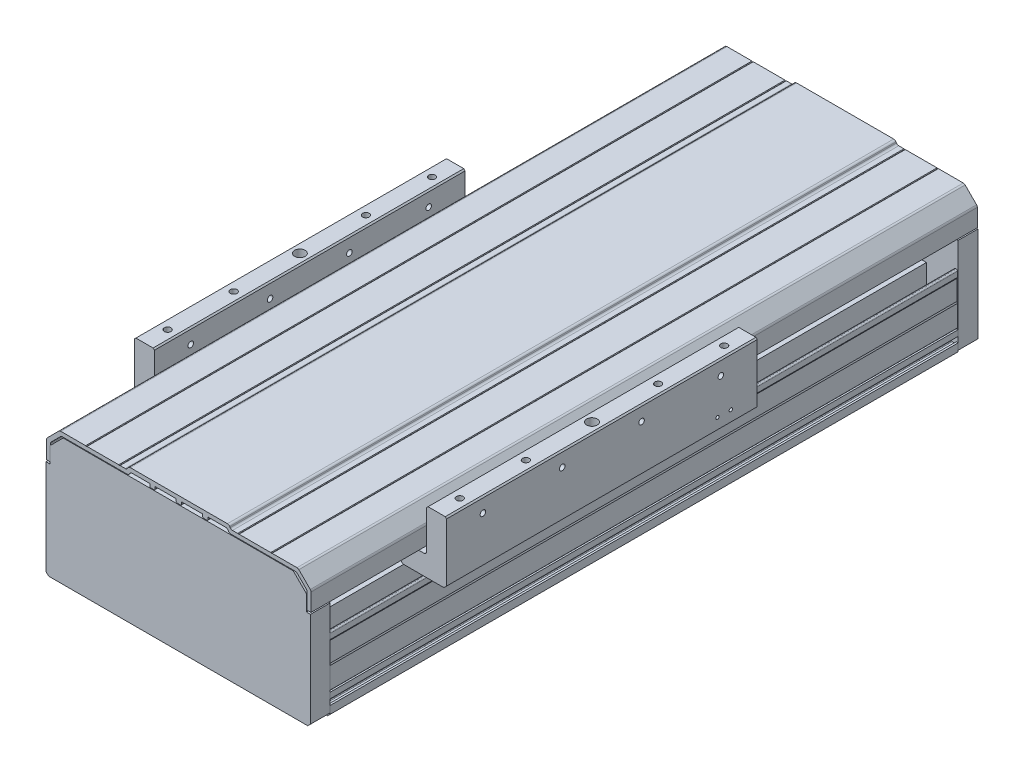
from build123d import *

# Parameters (mm, degrees)
EXTRUDE_1_DEPTH             = 237.5
EXTRUDE_2_DEPTH             = 15
EXTRUDE_3_DEPTH             = 15
EXTRUDE_4_DEPTH             = 235
EXTRUDE_5_DEPTH             = 252
HOLE_WIZARD_M8_1_AT_2_COUNT = 2
HOLE_WIZARD_M8_1_AT_2_PITCH = 173
PATTERN_LINEAR_1_COUNT      = 2
PATTERN_LINEAR_1_PITCH      = 240
HOLE_WIZARD_M6_1_AT_2_COUNT = 2
HOLE_WIZARD_M6_1_AT_2_PITCH = 50
HOLE_WIZARD_M6_1_AT_3_COUNT = 2
HOLE_WIZARD_M6_1_AT_3_PITCH = 150
HOLE_WIZARD_M6_1_AT_4_COUNT = 2
HOLE_WIZARD_M6_1_AT_4_PITCH = 200
HOLE_WIZARD_M5_1_AT_2_COUNT = 2
HOLE_WIZARD_M5_1_AT_2_PITCH = 60
HOLE_WIZARD_M5_1_AT_3_COUNT = 2
HOLE_WIZARD_M5_1_AT_3_PITCH = 120
HOLE_WIZARD_M5_1_AT_4_COUNT = 2
HOLE_WIZARD_M5_1_AT_4_PITCH = 180
SKETCH_13_R                 = 2.5
CUT_EXTRUDE_1_DEPTH         = 47
SKETCH_14_R                 = 4
CUT_EXTRUDE_2_DEPTH         = 18
HOLE_WIZARD_M3_1_AT_2_COUNT = 2
HOLE_WIZARD_M3_1_AT_2_PITCH = 10


with BuildPart() as part:
    # Sketch 1 → Extrude 1 (new, symmetric)
    # profile 1 of 3: a face of its own
    with BuildSketch(Plane.XY):
        with BuildLine():
            Line((-99, 33.5), (-99, 48.5))
            Line((-99, 48.5), (-99.5, 49.5))
            Line((-99.5, 49.5), (-99.5, 53.5))
            ThreePointArc((-99.5, 53.5), (-99.207106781, 54.207106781), (-98.5, 54.5))
            Line((-98.5, 54.5), (-98, 54.5))
            ThreePointArc((-98, 54.5), (-97.292893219, 54.207106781), (-97, 53.5))
            Line((-97, 53.5), (-97, 16.5))
            ThreePointArc((-97, 16.5), (-97.146446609, 16.146446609), (-97.5, 16))
            Line((-97.5, 16), (-99, 16))
            ThreePointArc((-99, 16), (-99.353553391, 16.146446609), (-99.5, 16.5))
            Line((-99.5, 16.5), (-99.5, 32.5))
            Line((-99.5, 32.5), (-99, 33.5))
        make_face()
    # profile 2 of 3: a face of its own
    with BuildSketch(Plane.XY):
        with BuildLine():
            Line((99, 33.5), (99, 48.5))
            Line((99, 48.5), (99.5, 49.5))
            Line((99.5, 49.5), (99.5, 53.5))
            ThreePointArc((99.5, 53.5), (99.207106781, 54.207106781), (98.5, 54.5))
            Line((98.5, 54.5), (98, 54.5))
            ThreePointArc((98, 54.5), (97.292893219, 54.207106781), (97, 53.5))
            Line((97, 53.5), (97, 16.5))
            ThreePointArc((97, 16.5), (97.146446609, 16.146446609), (97.5, 16))
            Line((97.5, 16), (99, 16))
            ThreePointArc((99, 16), (99.353553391, 16.146446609), (99.5, 16.5))
            Line((99.5, 16.5), (99.5, 32.5))
            Line((99.5, 32.5), (99, 33.5))
        make_face()
    # profile 3 of 3: a face of its own
    with BuildSketch(Plane.XY):
        with BuildLine():
            Line((-78, 44.5), (-43.5, 44.5))
            Line((-43.5, 44.5), (-43.5, 22.499959))
            ThreePointArc((-43.5, 22.499959), (-42.035533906, 18.964425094), (-38.5, 17.499959))
            Line((-38.5, 17.499959), (-38.5, 16.499959))
            Line((-38.5, 16.499959), (-22.9999959, 16.499959))
            Line((-22.9999959, 16.499959), (-22.5, 15.999959))
            Line((-22.5, 15.999959), (22.5, 15.999959))
            Line((22.5, 15.999959), (22.9999959, 16.499959))
            Line((22.9999959, 16.499959), (38.5, 16.499959))
            Line((38.5, 16.499959), (38.5, 17.499959))
            ThreePointArc((38.5, 17.499959), (42.035533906, 18.964425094), (43.5, 22.499959))
            Line((43.5, 22.499959), (43.5, 44.5))
            Line((43.5, 44.5), (71, 44.5))
            Line((71, 44.5), (71, 47.5))
            Line((71, 47.5), (76, 47.5))
            Line((76, 47.5), (76, 31.4999))
            Line((76, 31.4999), (76.3, 31.4999))
            Line((76.3, 31.4999), (76.3, 24.58099761))
            ThreePointArc((76.3, 24.58099761), (76.246719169, 24.583200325), (76.193631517, 24.588240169))
            ThreePointArc((76.193631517, 24.588240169), (74.617365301, 22.19481599), (77.476923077, 22.384615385))
            ThreePointArc((77.476923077, 22.384615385), (77.845299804, 22.832050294), (78.4, 23))
            Line((78.4, 23), (80.8, 23))
            Line((80.8, 23), (81, 22.8))
            Line((81, 22.8), (81, 21.2))
            Line((81, 21.2), (80.8, 21))
            Line((80.8, 21), (79.5, 21))
            Line((79.5, 21), (79.5, 18))
            Line((79.5, 18), (93.5, 18))
            Line((93.5, 18), (93.5, 21))
            Line((93.5, 21), (92.2, 21))
            Line((92.2, 21), (92, 21.2))
            Line((92, 21.2), (92, 22.8))
            Line((92, 22.8), (92.2, 23))
            Line((92.2, 23), (94, 23))
            ThreePointArc((94, 23), (94.707106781, 23.292893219), (95, 24))
            Line((95, 24), (95, 25.5))
            Line((95, 25.5), (97, 25.5))
            Line((97, 25.5), (97, 22.000000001))
            Line((97, 22.000000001), (96.7, 21.5))
            Line((96.7, 21.5), (97, 21))
            Line((97, 21), (97, 15.5))
            Line((97, 15.5), (100, 15.5))
            Line((100, 15.5), (99.999985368, 11.15))
            Line((99.999985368, 11.15), (98.499985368, 11.15))
            Line((98.499985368, 11.15), (98.499985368, 12.65))
            Line((98.499985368, 12.65), (95.499985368, 12.65))
            ThreePointArc((95.499985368, 12.65), (95.146431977, 12.503553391), (94.999985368, 12.15))
            Line((94.999985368, 12.15), (94.999985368, 5.85))
            ThreePointArc((94.999985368, 5.85), (95.146431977, 5.496446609), (95.499985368, 5.35))
            Line((95.499985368, 5.35), (98.499985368, 5.35))
            Line((98.499985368, 5.35), (98.499985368, 6.85))
            Line((98.499985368, 6.85), (99.999985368, 6.85))
            Line((99.999985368, 6.85), (100, 1))
            Line((100, 1), (98, -1))
            Line((98, -1), (36, -1))
            Line((36, -1), (35, 0))
            Line((35, 0), (-35, 0))
            Line((-35, 0), (-36, -1))
            Line((-36, -1), (-98, -1))
            Line((-98, -1), (-100, 1))
            Line((-100, 1), (-99.999985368, 6.85))
            Line((-99.999985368, 6.85), (-98.499985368, 6.85))
            Line((-98.499985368, 6.85), (-98.499985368, 5.35))
            Line((-98.499985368, 5.35), (-95.499985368, 5.35))
            ThreePointArc((-95.499985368, 5.35), (-95.146431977, 5.496446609), (-94.999985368, 5.85))
            Line((-94.999985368, 5.85), (-94.999985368, 12.15))
            ThreePointArc((-94.999985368, 12.15), (-95.146431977, 12.503553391), (-95.499985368, 12.65))
            Line((-95.499985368, 12.65), (-98.499985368, 12.65))
            Line((-98.499985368, 12.65), (-98.499985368, 11.15))
            Line((-98.499985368, 11.15), (-99.999985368, 11.15))
            Line((-99.999985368, 11.15), (-100, 15.5))
            Line((-100, 15.5), (-97, 15.5))
            Line((-97, 15.5), (-97, 21))
            Line((-97, 21), (-96.7, 21.5))
            Line((-96.7, 21.5), (-97, 22))
            Line((-97, 22), (-97, 25.5))
            Line((-97, 25.5), (-95, 25.5))
            Line((-95, 25.5), (-95, 24))
            ThreePointArc((-95, 24), (-94.707106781, 23.292893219), (-94, 23))
            Line((-94, 23), (-92.2, 23))
            Line((-92.2, 23), (-92, 22.8))
            Line((-92, 22.8), (-92, 21.2))
            Line((-92, 21.2), (-92.2, 21))
            Line((-92.2, 21), (-93.5, 21))
            Line((-93.5, 21), (-93.5, 18))
            Line((-93.5, 18), (-79.5, 18))
            Line((-79.5, 18), (-79.5, 21))
            Line((-79.5, 21), (-80.8, 21))
            Line((-80.8, 21), (-81, 21.2))
            Line((-81, 21.2), (-81, 22.8))
            Line((-81, 22.8), (-80.8, 23))
            Line((-80.8, 23), (-78.4, 23))
            ThreePointArc((-78.4, 23), (-77.845299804, 22.832050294), (-77.476923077, 22.384615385))
            ThreePointArc((-77.476923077, 22.384615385), (-74.617365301, 22.19481599), (-76.193631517, 24.588240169))
            ThreePointArc((-76.193631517, 24.588240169), (-76.76123201, 24.686146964), (-77.180676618, 25.080890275))
            Line((-77.180676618, 25.080890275), (-78, 26.5))
            Line((-78, 26.5), (-78, 36.5))
            Line((-78, 36.5), (-77.7, 37))
            Line((-77.7, 37), (-78, 37.5))
            Line((-78, 37.5), (-78, 44.5))
        make_face()
        with BuildLine():
            Line((-66.55, 32.5), (-54.5, 32.5))
            ThreePointArc((-54.5, 32.5), (-53.085786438, 31.914213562), (-52.5, 30.5))
            Line((-52.5, 30.5), (-52.5, 16.25))
            ThreePointArc((-52.5, 16.25), (-52.353553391, 15.896446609), (-52, 15.75))
            Line((-52, 15.75), (-51.407878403, 15.75))
            ThreePointArc((-51.407878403, 15.75), (-51.235654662, 15.780597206), (-51.084509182, 15.868644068))
            ThreePointArc((-51.084509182, 15.868644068), (-47.054594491, 13.850026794), (-51.300978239, 12.338983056))
            ThreePointArc((-51.300978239, 12.338983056), (-51.467890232, 12.457980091), (-51.668524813, 12.5))
            Line((-51.668524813, 12.5), (-67.5, 12.5))
            ThreePointArc((-67.5, 12.5), (-68.914213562, 13.085786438), (-69.5, 14.5))
            Line((-69.5, 14.5), (-69.5, 30.092681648))
            ThreePointArc((-69.5, 30.092681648), (-69.617656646, 30.414882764), (-69.915254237, 30.58544747))
            ThreePointArc((-69.915254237, 30.58544747), (-71.07878547, 34.873482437), (-67.05, 33))
            ThreePointArc((-67.05, 33), (-66.903553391, 32.646446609), (-66.55, 32.5))
        make_face(mode=Mode.SUBTRACT)
        with BuildLine():
            Line((-16.901923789, 9.5), (-14.303847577, 11))
            Line((-14.303847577, 11), (-7.333333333, 11))
            Line((-7.333333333, 11), (-4, 9))
            Line((-4, 9), (4, 9))
            Line((4, 9), (7.333333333, 11))
            Line((7.333333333, 11), (14.303847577, 11))
            Line((14.303847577, 11), (16.901923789, 9.5))
            Line((16.901923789, 9.5), (18.062862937, 9.5))
            ThreePointArc((18.062862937, 9.5), (22.45, 8), (18.062862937, 6.5))
            Line((18.062862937, 6.5), (16.901923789, 6.5))
            Line((16.901923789, 6.5), (14.303847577, 5))
            Line((14.303847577, 5), (-14.303847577, 5))
            Line((-14.303847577, 5), (-16.901923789, 6.5))
            Line((-16.901923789, 6.5), (-18.062862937, 6.5))
            ThreePointArc((-18.062862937, 6.5), (-22.45, 8), (-18.062862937, 9.5))
            Line((-18.062862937, 9.5), (-16.901923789, 9.5))
        make_face(mode=Mode.SUBTRACT)
        with BuildLine():
            Line((66.549999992, 32.500000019), (54.499999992, 32.500000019))
            ThreePointArc((54.499999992, 32.500000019), (53.085786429, 31.914213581), (52.499999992, 30.500000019))
            Line((52.499999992, 30.500000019), (52.499999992, 16.250000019))
            ThreePointArc((52.499999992, 16.250000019), (52.353553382, 15.896446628), (51.999999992, 15.750000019))
            Line((51.999999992, 15.750000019), (51.407878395, 15.750000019))
            ThreePointArc((51.407878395, 15.750000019), (51.235654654, 15.780597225), (51.084509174, 15.868644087))
            ThreePointArc((51.084509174, 15.868644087), (47.054594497, 13.850026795), (51.30097824, 12.338983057))
            ThreePointArc((51.30097824, 12.338983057), (51.467890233, 12.457980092), (51.668524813, 12.5))
            Line((51.668524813, 12.5), (67.5, 12.5))
            ThreePointArc((67.5, 12.5), (68.914213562, 13.085786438), (69.5, 14.5))
            Line((69.5, 14.5), (69.5, 30.092681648))
            ThreePointArc((69.5, 30.092681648), (69.617656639, 30.414882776), (69.915254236, 30.585447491))
            ThreePointArc((69.915254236, 30.585447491), (71.078785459, 34.873482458), (67.049999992, 33.000000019))
            ThreePointArc((67.049999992, 33.000000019), (66.903553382, 32.646446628), (66.549999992, 32.500000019))
        make_face(mode=Mode.SUBTRACT)
    extrude(amount=EXTRUDE_1_DEPTH, both=True)

    # Sketch 7 → Hole Wizard M8 _ _ _ _1 (revolve, cut)
    with BuildSketch(Plane(origin=(-86.5, 18, 120), x_dir=(0, 0, 1), z_dir=(1, 0, 0))):
        Polygon((0, 0), (0, 19), (4.5, 19), (4.5, 9), (7, 9), (7, 0), align=None)
    hole_wizard_m8_1 = revolve(axis=Axis((-86.5, 24.35, 120), (0, -1, 0)), mode=Mode.SUBTRACT)

    # Hole Wizard M8 _ _ _ _1 at 2: Hole Wizard M8 _ _ _ _1 ×2
    with Locations(*[(i * HOLE_WIZARD_M8_1_AT_2_PITCH, 0, 0) for i in range(1, HOLE_WIZARD_M8_1_AT_2_COUNT)]):
        add(hole_wizard_m8_1, mode=Mode.SUBTRACT)

    # Pattern Linear 1: Hole Wizard M8 _ _ _ _1 ×2
    with Locations(*[(0, 0, -i * PATTERN_LINEAR_1_PITCH) for i in range(1, PATTERN_LINEAR_1_COUNT)]):
        add(hole_wizard_m8_1, mode=Mode.SUBTRACT)

    # Pattern Linear 1 copy 1 sketch → Pattern Linear 1 copy 1 (revolve, cut)
    with BuildSketch(Plane(origin=(86.5, 18, -120), x_dir=(0, 0, 1), z_dir=(1, 0, 0))):
        Polygon((0, 0), (0, 19), (4.5, 19), (4.5, 9), (7, 9), (7, 0), align=None)
    revolve(axis=Axis((86.5, 24.35, -120), (0, -1, 0)), mode=Mode.SUBTRACT)


with BuildPart() as body_2:
    # Sketch 2 → Extrude 2 (new body)
    with BuildSketch(Plane.XY.offset(237.5)):
        Polygon((97.000014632, 86.000015), (87.000014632, 96.000015), (-86.999985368, 96.000015), (-96.999985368, 86.000015), (-96.999985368, 74), (-99.999985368, 74), (-99.999985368, 2), (-97.999985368, 0), (97.999985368, 0), (100.000014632, 2.000029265), (100.000014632, 74), (97.000014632, 74), align=None)
    extrude(amount=EXTRUDE_2_DEPTH)


with BuildPart() as body_3:
    # Sketch 3 → Extrude 3 (new body)
    with BuildSketch(Plane(origin=(0, 0, -237.5), x_dir=(-1, 0, 0), z_dir=(0, 0, -1))):
        Polygon((97.000014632, 86.000015), (87.000014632, 96.000015), (-86.999985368, 96.000015), (-96.999985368, 86.000015), (-96.999985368, 74), (-99.999985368, 74), (-99.999985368, 2), (-97.999985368, 0), (97.999985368, 0), (100.000014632, 2.000029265), (100.000014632, 74), (97.000014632, 74), align=None)
    extrude(amount=EXTRUDE_3_DEPTH)


with BuildPart() as body_4:
    # Sketch 4 → Extrude 4 (new body)
    with BuildSketch(Plane.XY.offset(167.5)):
        with BuildLine():
            ThreePointArc((-103, 74), (-102.414213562, 72.585786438), (-101, 72))
            Line((-101, 72), (-96, 72))
            ThreePointArc((-96, 72), (-94.585786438, 72.585786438), (-94, 74))
            Line((-94, 74), (-94, 77.5))
            ThreePointArc((-94, 77.5), (-91.071067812, 84.571067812), (-84, 87.5))
            Line((-84, 87.5), (-58.5, 87.5))
            Line((-58.5, 87.5), (-56.5, 89.5))
            Line((-56.5, 89.5), (56.5, 89.5))
            Line((56.5, 89.5), (58.5, 87.5))
            Line((58.5, 87.5), (84, 87.5))
            ThreePointArc((84, 87.5), (91.071067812, 84.571067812), (94, 77.5))
            Line((94, 77.5), (94, 74))
            ThreePointArc((94, 74), (94.585786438, 72.585786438), (96, 72))
            Line((96, 72), (101, 72))
            ThreePointArc((101, 72), (102.414213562, 72.585786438), (103, 74))
            Line((103, 74), (103, 103))
            Line((103, 103), (104, 104))
            Line((104, 104), (117, 104))
            Line((117, 104), (118, 103))
            Line((118, 103), (118, 59))
            Line((118, 59), (116, 57))
            Line((116, 57), (85, 57))
            Line((85, 57), (83, 59))
            Line((83, 59), (83, 72.5))
            Line((83, 72.5), (-83, 72.5))
            Line((-83, 72.5), (-83, 59))
            Line((-83, 59), (-85, 57))
            Line((-85, 57), (-116, 57))
            Line((-116, 57), (-118, 59))
            Line((-118, 59), (-118, 103))
            Line((-118, 103), (-117, 104))
            Line((-117, 104), (-104, 104))
            Line((-104, 104), (-103, 103))
            Line((-103, 103), (-103, 74))
        make_face()
    extrude(amount=-EXTRUDE_4_DEPTH)

    # Sketch 9 → Hole Wizard M6 _ _1 (revolve, cut)
    with BuildSketch(Plane(origin=(110.5, 104, 150), x_dir=(0, 0, 1), z_dir=(1, 0, 0))):
        Polygon((0, 0), (0, 24.502151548), (2.5, 23), (2.5, 0), align=None)
    hole_wizard_m6_1 = revolve(axis=Axis((110.5, 110.35, 150), (0, -1, 0)), mode=Mode.SUBTRACT)

    # Hole Wizard M6 _ _1 at 2: Hole Wizard M6 _ _1 ×2
    with Locations(*[(0, 0, -i * HOLE_WIZARD_M6_1_AT_2_PITCH) for i in range(1, HOLE_WIZARD_M6_1_AT_2_COUNT)]):
        add(hole_wizard_m6_1, mode=Mode.SUBTRACT)

    # Hole Wizard M6 _ _1 at 3: Hole Wizard M6 _ _1 ×2
    with Locations(*[(0, 0, -i * HOLE_WIZARD_M6_1_AT_3_PITCH) for i in range(1, HOLE_WIZARD_M6_1_AT_3_COUNT)]):
        add(hole_wizard_m6_1, mode=Mode.SUBTRACT)

    # Hole Wizard M6 _ _1 at 4: Hole Wizard M6 _ _1 ×2
    with Locations(*[(0, 0, -i * HOLE_WIZARD_M6_1_AT_4_PITCH) for i in range(1, HOLE_WIZARD_M6_1_AT_4_COUNT)]):
        add(hole_wizard_m6_1, mode=Mode.SUBTRACT)

    # Sketch 11 → Hole Wizard M5 _ _1 (revolve, cut)
    with BuildSketch(Plane(origin=(118, 93, 140), x_dir=(0, 0, -1), z_dir=(0, 1, 0))):
        Polygon((0, 0), (0, 17.2618073), (2.1, 16), (2.1, 0), align=None)
    hole_wizard_m5_1 = revolve(axis=Axis((124.35, 93, 140), (-1, 0, 0)), mode=Mode.SUBTRACT)

    # Hole Wizard M5 _ _1 at 2: Hole Wizard M5 _ _1 ×2
    with Locations(*[(0, 0, -i * HOLE_WIZARD_M5_1_AT_2_PITCH) for i in range(1, HOLE_WIZARD_M5_1_AT_2_COUNT)]):
        add(hole_wizard_m5_1, mode=Mode.SUBTRACT)

    # Hole Wizard M5 _ _1 at 3: Hole Wizard M5 _ _1 ×2
    with Locations(*[(0, 0, -i * HOLE_WIZARD_M5_1_AT_3_PITCH) for i in range(1, HOLE_WIZARD_M5_1_AT_3_COUNT)]):
        add(hole_wizard_m5_1, mode=Mode.SUBTRACT)

    # Hole Wizard M5 _ _1 at 4: Hole Wizard M5 _ _1 ×2
    with Locations(*[(0, 0, -i * HOLE_WIZARD_M5_1_AT_4_PITCH) for i in range(1, HOLE_WIZARD_M5_1_AT_4_COUNT)]):
        add(hole_wizard_m5_1, mode=Mode.SUBTRACT)

    # Sketch 13 → Cut-Extrude 1 (cut)
    with BuildSketch(Plane(origin=(0, 104, 0), x_dir=(1, 0, 0), z_dir=(0, 1, 0))):
        with Locations(Location((110.5, -50, 0), (0, 0, 270))):
            Circle(SKETCH_13_R)
    cut_extrude_1 = extrude(amount=-CUT_EXTRUDE_1_DEPTH, mode=Mode.SUBTRACT)

    # Sketch 14 → Cut-Extrude 2 (cut)
    with BuildSketch(Plane(origin=(0, 104, 0), x_dir=(1, 0, 0), z_dir=(0, 1, 0))):
        with Locations(Location((110.5, -50, 0), (0, 0, 270))):
            Circle(SKETCH_14_R)
    cut_extrude_2 = extrude(amount=-CUT_EXTRUDE_2_DEPTH, mode=Mode.SUBTRACT)

    # Mirror 1: Hole Wizard M6 _ _1, Hole Wizard M5 _ _1, Cut-Extrude 1, Cut-Extrude 2 across plane
    add(hole_wizard_m6_1.mirror(Plane(origin=(0, 0, 0), x_dir=(0, 0, 1), z_dir=(1, 0, 0))), mode=Mode.SUBTRACT)
    add(hole_wizard_m5_1.mirror(Plane(origin=(0, 0, 0), x_dir=(0, 0, 1), z_dir=(1, 0, 0))), mode=Mode.SUBTRACT)
    add(cut_extrude_1.mirror(Plane(origin=(0, 0, 0), x_dir=(0, 0, 1), z_dir=(1, 0, 0))), mode=Mode.SUBTRACT)
    add(cut_extrude_2.mirror(Plane(origin=(0, 0, 0), x_dir=(0, 0, 1), z_dir=(1, 0, 0))), mode=Mode.SUBTRACT)

    # Mirror 1 copy 1 sketch → Mirror 1 copy 1 (revolve, cut)
    with BuildSketch(Plane(origin=(-110.5, 104, 100), x_dir=(0, 0, 1), z_dir=(-1, 0, 0))):
        Polygon((0, 0), (0, -24.502151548), (2.5, -23), (2.5, 0), align=None)
    revolve(axis=Axis((-110.5, 110.35, 100), (0, 1, 0)), mode=Mode.SUBTRACT)

    # Mirror 1 copy 2 sketch → Mirror 1 copy 2 (revolve, cut)
    with BuildSketch(Plane(origin=(-110.5, 104, 0), x_dir=(0, 0, 1), z_dir=(-1, 0, 0))):
        Polygon((0, 0), (0, -24.502151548), (2.5, -23), (2.5, 0), align=None)
    revolve(axis=Axis((-110.5, 110.35, 0), (0, 1, 0)), mode=Mode.SUBTRACT)

    # Mirror 1 copy 3 sketch → Mirror 1 copy 3 (revolve, cut)
    with BuildSketch(Plane(origin=(-110.5, 104, -50), x_dir=(0, 0, 1), z_dir=(-1, 0, 0))):
        Polygon((0, 0), (0, -24.502151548), (2.5, -23), (2.5, 0), align=None)
    revolve(axis=Axis((-110.5, 110.35, -50), (0, 1, 0)), mode=Mode.SUBTRACT)

    # Mirror 1 copy 4 sketch → Mirror 1 copy 4 (revolve, cut)
    with BuildSketch(Plane(origin=(-118, 93, 80), x_dir=(0, 0, -1), z_dir=(0, 1, 0))):
        Polygon((0, 0), (0, -17.2618073), (2.1, -16), (2.1, 0), align=None)
    revolve(axis=Axis((-124.35, 93, 80), (-1, 0, 0)), mode=Mode.SUBTRACT)

    # Mirror 1 copy 5 sketch → Mirror 1 copy 5 (revolve, cut)
    with BuildSketch(Plane(origin=(-118, 93, 20), x_dir=(0, 0, -1), z_dir=(0, 1, 0))):
        Polygon((0, 0), (0, -17.2618073), (2.1, -16), (2.1, 0), align=None)
    revolve(axis=Axis((-124.35, 93, 20), (-1, 0, 0)), mode=Mode.SUBTRACT)

    # Mirror 1 copy 6 sketch → Mirror 1 copy 6 (revolve, cut)
    with BuildSketch(Plane(origin=(-118, 93, -40), x_dir=(0, 0, -1), z_dir=(0, 1, 0))):
        Polygon((0, 0), (0, -17.2618073), (2.1, -16), (2.1, 0), align=None)
    revolve(axis=Axis((-124.35, 93, -40), (-1, 0, 0)), mode=Mode.SUBTRACT)

    # Sketch 15 → Hole Wizard M3 _ _1 (revolve, cut)
    with BuildSketch(Plane(origin=(118, 67, -47.5), x_dir=(0, 0, -1), z_dir=(0, 1, 0))):
        Polygon((0, 0), (0, 13.251075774), (1.25, 12.5), (1.25, 0), align=None)
    hole_wizard_m3_1 = revolve(axis=Axis((124.35, 67, -47.5), (-1, 0, 0)), mode=Mode.SUBTRACT)

    # Hole Wizard M3 _ _1 at 2: Hole Wizard M3 _ _1 ×2
    with Locations(*[(0, 0, i * HOLE_WIZARD_M3_1_AT_2_PITCH) for i in range(1, HOLE_WIZARD_M3_1_AT_2_COUNT)]):
        add(hole_wizard_m3_1, mode=Mode.SUBTRACT)

    # Mirror 2: Hole Wizard M3 _ _1 across plane
    add(hole_wizard_m3_1.mirror(Plane(origin=(0, 0, 0), x_dir=(0, 0, 1), z_dir=(1, 0, 0))), mode=Mode.SUBTRACT)

    # Mirror 2 copy 1 sketch → Mirror 2 copy 1 (revolve, cut)
    with BuildSketch(Plane(origin=(-118, 67, -37.5), x_dir=(0, 0, -1), z_dir=(0, 1, 0))):
        Polygon((0, 0), (0, -13.251075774), (1.25, -12.5), (1.25, 0), align=None)
    revolve(axis=Axis((-124.35, 67, -37.5), (-1, 0, 0)), mode=Mode.SUBTRACT)


with BuildPart() as body_5:
    # Sketch 5 → Extrude 5 (new, symmetric)
    with BuildSketch(Plane.XY):
        with BuildLine():
            Line((36.749407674, 101.5), (-36.749407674, 101.5))
            ThreePointArc((-36.749407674, 101.5), (-37.719816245, 101.248801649), (-38.446459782, 100.558307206))
            Line((-38.446459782, 100.558307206), (-38.830989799, 99.941692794))
            ThreePointArc((-38.830989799, 99.941692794), (-39.557633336, 99.251198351), (-40.528041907, 99))
            Line((-40.528041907, 99), (-44.5, 99))
            Line((-44.5, 99), (-45, 98.7))
            Line((-45, 98.7), (-45.5, 99))
            Line((-45.5, 99), (-69.5, 99))
            Line((-69.5, 99), (-70, 98.7))
            Line((-70, 98.7), (-70.5, 99))
            Line((-70.5, 99), (-89.369129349, 99))
            ThreePointArc((-89.369129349, 99), (-90.134496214, 98.847759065), (-90.783342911, 98.414213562))
            Line((-90.783342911, 98.414213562), (-99.414213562, 89.783342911))
            ThreePointArc((-99.414213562, 89.783342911), (-99.847759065, 89.134496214), (-100, 88.369129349))
            Line((-100, 88.369129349), (-100, 75))
            Line((-100, 75), (-97, 75))
            Line((-97, 75), (-97, 87.126488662))
            ThreePointArc((-97, 87.126488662), (-96.847759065, 87.891855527), (-96.414213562, 88.540702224))
            Line((-96.414213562, 88.540702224), (-89.540702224, 95.414213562))
            ThreePointArc((-89.540702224, 95.414213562), (-88.891855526, 95.847759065), (-88.126488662, 96))
            Line((-88.126488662, 96), (-39.21505842, 96))
            ThreePointArc((-39.21505842, 96), (-38.244649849, 96.251198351), (-37.518006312, 96.941692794))
            Line((-37.518006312, 96.941692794), (-37.133476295, 97.558307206))
            ThreePointArc((-37.133476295, 97.558307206), (-36.406832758, 98.248801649), (-35.436424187, 98.5))
            Line((-35.436424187, 98.5), (-22.25, 98.5))
            ThreePointArc((-22.25, 98.5), (-22.073223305, 98.426776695), (-22, 98.25))
            Line((-22, 98.25), (-22, 96.75))
            ThreePointArc((-22, 96.75), (-21.780330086, 96.219669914), (-21.25, 96))
            Line((-21.25, 96), (-18.75, 96))
            ThreePointArc((-18.75, 96), (-18.219669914, 96.219669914), (-18, 96.75))
            Line((-18, 96.75), (-18, 98.25))
            ThreePointArc((-18, 98.25), (-17.926776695, 98.426776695), (-17.75, 98.5))
            Line((-17.75, 98.5), (-2.25, 98.5))
            ThreePointArc((-2.25, 98.5), (-2.073223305, 98.426776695), (-2, 98.25))
            Line((-2, 98.25), (-2, 96.75))
            ThreePointArc((-2, 96.75), (-1.780330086, 96.219669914), (-1.25, 96))
            Line((-1.25, 96), (1.25, 96))
            ThreePointArc((1.25, 96), (1.780330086, 96.219669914), (2, 96.75))
            Line((2, 96.75), (2, 98.25))
            ThreePointArc((2, 98.25), (2.073223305, 98.426776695), (2.25, 98.5))
            Line((2.25, 98.5), (17.75, 98.5))
            ThreePointArc((17.75, 98.5), (17.926776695, 98.426776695), (18, 98.25))
            Line((18, 98.25), (18, 96.75))
            ThreePointArc((18, 96.75), (18.219669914, 96.219669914), (18.75, 96))
            Line((18.75, 96), (21.25, 96))
            ThreePointArc((21.25, 96), (21.780330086, 96.219669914), (22, 96.75))
            Line((22, 96.75), (22, 98.25))
            ThreePointArc((22, 98.25), (22.073223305, 98.426776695), (22.25, 98.5))
            Line((22.25, 98.5), (35.436424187, 98.5))
            ThreePointArc((35.436424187, 98.5), (36.406832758, 98.248801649), (37.133476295, 97.558307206))
            Line((37.133476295, 97.558307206), (37.518006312, 96.941692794))
            ThreePointArc((37.518006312, 96.941692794), (38.244649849, 96.251198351), (39.21505842, 96))
            Line((39.21505842, 96), (88.126488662, 96))
            ThreePointArc((88.126488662, 96), (88.891855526, 95.847759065), (89.540702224, 95.414213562))
            Line((89.540702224, 95.414213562), (96.414213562, 88.540702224))
            ThreePointArc((96.414213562, 88.540702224), (96.847759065, 87.891855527), (97, 87.126488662))
            Line((97, 87.126488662), (97, 75))
            Line((97, 75), (100, 75))
            Line((100, 75), (100, 88.369129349))
            ThreePointArc((100, 88.369129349), (99.847759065, 89.134496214), (99.414213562, 89.783342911))
            Line((99.414213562, 89.783342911), (90.783342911, 98.414213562))
            ThreePointArc((90.783342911, 98.414213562), (90.134496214, 98.847759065), (89.369129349, 99))
            Line((89.369129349, 99), (70.5, 99))
            Line((70.5, 99), (70, 98.7))
            Line((70, 98.7), (69.5, 99))
            Line((69.5, 99), (45.5, 99))
            Line((45.5, 99), (45, 98.7))
            Line((45, 98.7), (44.5, 99))
            Line((44.5, 99), (40.528041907, 99))
            ThreePointArc((40.528041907, 99), (39.557633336, 99.251198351), (38.830989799, 99.941692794))
            Line((38.830989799, 99.941692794), (38.446459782, 100.558307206))
            ThreePointArc((38.446459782, 100.558307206), (37.719816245, 101.248801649), (36.749407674, 101.5))
        make_face()
    extrude(amount=EXTRUDE_5_DEPTH, both=True)


solid = Compound([part.part, body_2.part, body_3.part, body_4.part, body_5.part])
